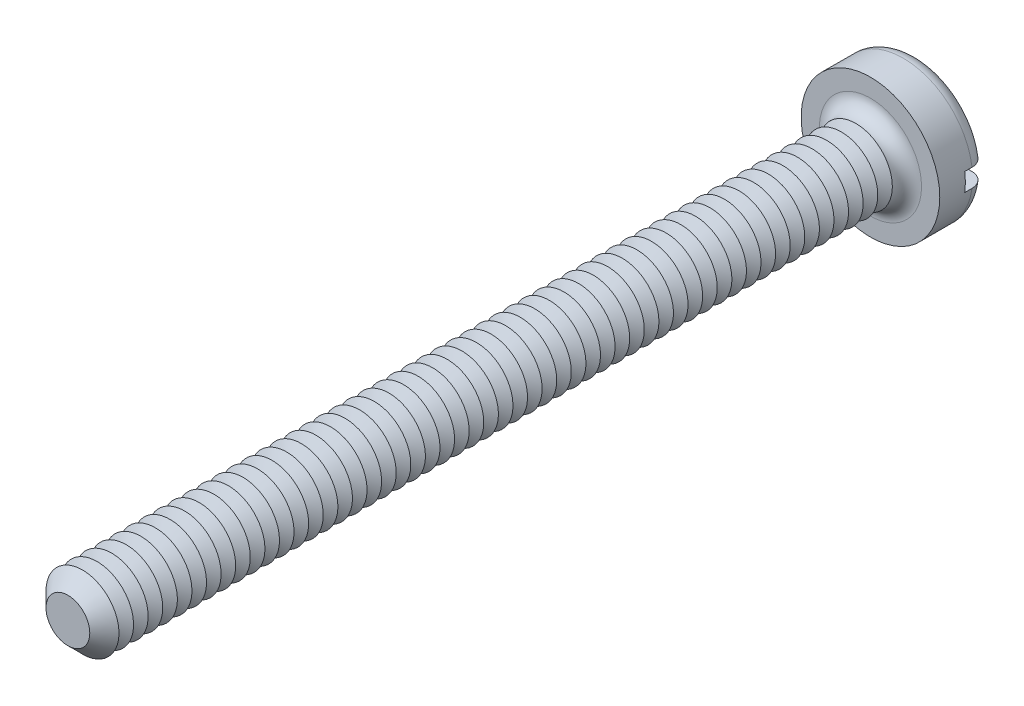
from build123d import *

# Parameters (mm, degrees)
SKETCH3_R           = 1.9
BOSS_EXTRUDE2_DEPTH = 1.3
SKETCH4_R           = 1
BOSS_EXTRUDE3_DEPTH = 22
FILLET1_R           = 0.4
CHAMFER1_SIZE       = 0.4
LPATTERN1_COUNT     = 53
LPATTERN1_PITCH     = 0.4
SKETCH8_W           = 3.8
SKETCH8_H           = 0.5
CUT_EXTRUDE1_DEPTH  = 0.6


with BuildPart() as part:
    # Sketch3 → Boss-Extrude2 (new body)
    with BuildSketch(Plane.XY):
        Circle(SKETCH3_R)
    extrude(amount=-BOSS_EXTRUDE2_DEPTH)

    # Sketch4 → Boss-Extrude3 (add)
    with BuildSketch(Plane.XY):
        Circle(SKETCH4_R)
    extrude(amount=BOSS_EXTRUDE3_DEPTH)

    # Fillet1
    fillet1_edges = [part.edges().sort_by_distance(p)[0] for p in [
        (-1.9, 0, -1.3),
        (-1, 0, 0),
    ]]
    fillet(fillet1_edges, radius=FILLET1_R)

    # Chamfer1
    chamfer1_edges = [part.edges().sort_by_distance(p)[0] for p in [
        (-1, 0, 22),
    ]]
    chamfer(chamfer1_edges, length=CHAMFER1_SIZE)

    # Sketch6 → Cut-Revolve1 (revolve, cut)
    with BuildSketch(Plane(origin=(0, 0, 0), x_dir=(0, 0, -1), z_dir=(1, 0, 0)), mode=Mode.PRIVATE) as cut_revolve1_sk:
        Polygon((-0.4, 1), (-0.6, 0.653589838), (-0.8, 1), align=None)
    cut_revolve1 = revolve(cut_revolve1_sk.sketch.rotate(Axis((0, 0, -1.694361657), (0, 0, 1)), 90), axis=Axis((0, 0, -1.694361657), (0, 0, 1)), mode=Mode.SUBTRACT)

    # LPattern1: Cut-Revolve1 ×53
    with Locations(*[(0, 0, i * LPATTERN1_PITCH) for i in range(1, LPATTERN1_COUNT)]):
        add(cut_revolve1, mode=Mode.SUBTRACT)

    # Sketch8 → Cut-Extrude1 (cut)
    with BuildSketch(Plane(origin=(0, 0, -1.3), x_dir=(-1, 0, 0), z_dir=(0, 0, -1))):
        Rectangle(SKETCH8_W, SKETCH8_H)
    extrude(amount=-CUT_EXTRUDE1_DEPTH, mode=Mode.SUBTRACT)


solid = part.part
